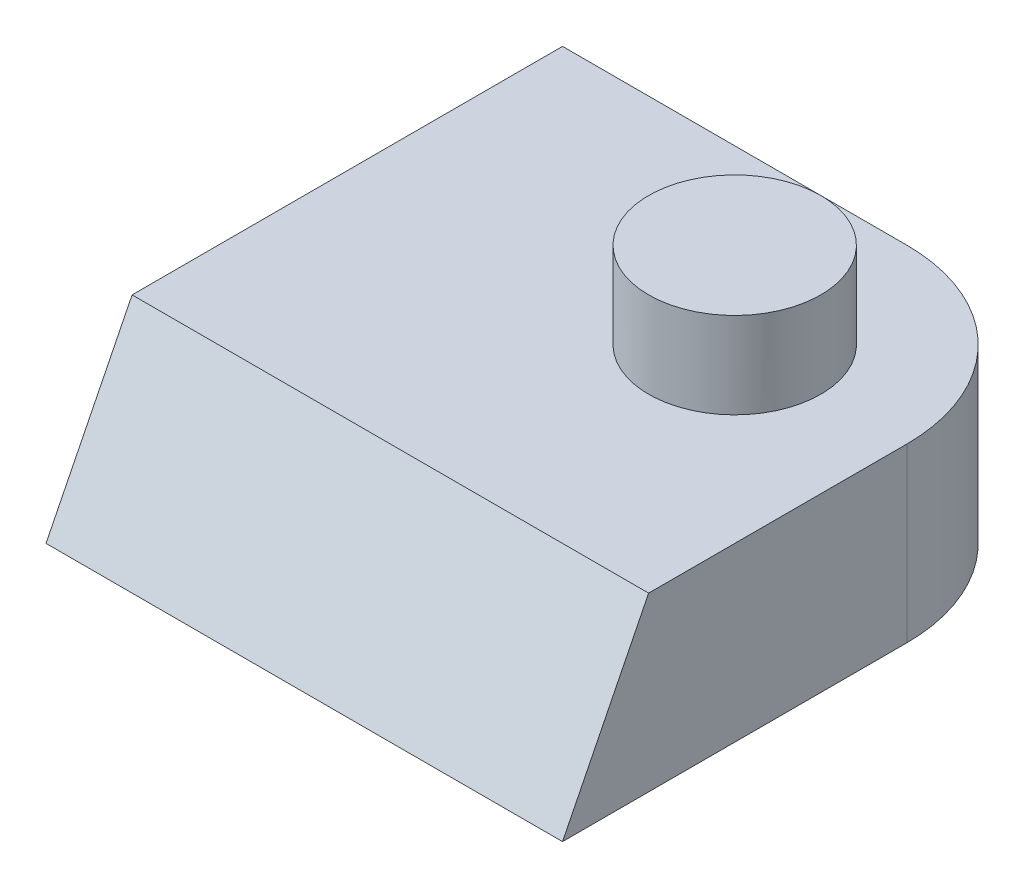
from build123d import *

# Parameters (mm, degrees)
SKETCH_2_W          = 60
SKETCH_2_H          = 60
EXTRUDE_2_DEPTH     = 20
CUT_EXTRUDE_1_DEPTH = 71
FILLET_1_R          = 20
SKETCH_4_R          = 10
EXTRUDE_3_DEPTH     = 10


with BuildPart() as part:
    # Sketch 2 → Extrude 2 (new body)
    with BuildSketch(Plane(origin=(0, 0, 0), x_dir=(1, 0, 0), z_dir=(0, 1, 0))):
        Rectangle(SKETCH_2_W, SKETCH_2_H)
    extrude(amount=EXTRUDE_2_DEPTH)

    # Sketch 3 → Cut-Extrude 1 (cut, through all)
    with BuildSketch(Plane(origin=(30, 0, 0), x_dir=(0, 0, -1), z_dir=(1, 0, 0))):
        Polygon((-20, 20), (-30, 0), (-30, 20), align=None)
    extrude(amount=-CUT_EXTRUDE_1_DEPTH, mode=Mode.SUBTRACT)

    # Fillet 1
    fillet_1_edges = [part.edges().sort_by_distance(p)[0] for p in [
        (30, 10, -30),
    ]]
    fillet(fillet_1_edges, radius=FILLET_1_R)

    # Sketch 4 → Extrude 3 (add)
    with BuildSketch(Plane(origin=(0, 20, 0), x_dir=(1, 0, 0), z_dir=(0, 1, 0))):
        with Locations(Location((10, 10, 0), (0, 0, 90))):
            Circle(SKETCH_4_R)
    extrude(amount=EXTRUDE_3_DEPTH)


solid = part.part
